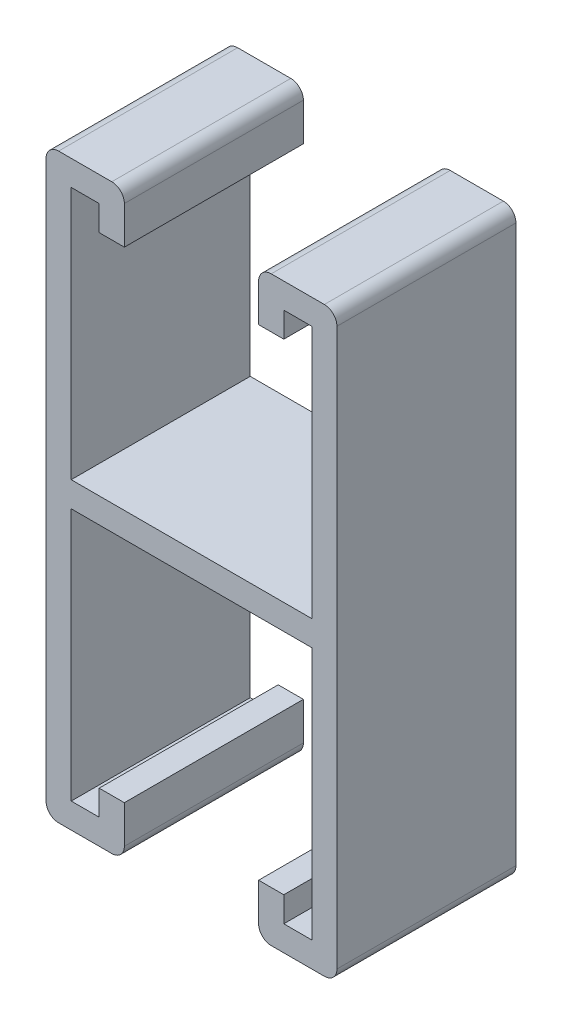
from build123d import *

# Parameters (mm, degrees)
BASE_EXTRUDE_DEPTH = 12.7


with BuildPart() as part:
    # Sketch1 → Base-Extrude (new, symmetric)
    with BuildSketch(Plane.XY):
        with BuildLine():
            Line((-11.3109375, 41.275), (-18.8515625, 41.275))
            ThreePointArc((-18.8515625, 41.275), (-20.114411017, 40.751911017), (-20.6375, 39.4890625))
            Line((-20.6375, 39.4890625), (-20.6375, -39.4890625))
            ThreePointArc((-20.6375, -39.4890625), (-20.114411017, -40.751911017), (-18.8515625, -41.275))
            Line((-18.8515625, -41.275), (-11.3109375, -41.275))
            ThreePointArc((-11.3109375, -41.275), (-10.048088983, -40.751911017), (-9.525, -39.4890625))
            Line((-9.525, -39.4890625), (-9.525, -34.13125))
            Line((-9.525, -34.13125), (-13.096875, -34.13125))
            Line((-13.096875, -34.13125), (-13.096875, -37.703125))
            Line((-13.096875, -37.703125), (-17.065625, -37.703125))
            Line((-17.065625, -37.703125), (-17.065625, -1.7859375))
            Line((-17.065625, -1.7859375), (17.065625, -1.7859375))
            Line((17.065625, -1.7859375), (17.065625, -37.703125))
            Line((17.065625, -37.703125), (13.096875, -37.703125))
            Line((13.096875, -37.703125), (13.096875, -34.13125))
            Line((13.096875, -34.13125), (9.525, -34.13125))
            Line((9.525, -34.13125), (9.525, -39.4890625))
            ThreePointArc((9.525, -39.4890625), (10.048088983, -40.751911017), (11.3109375, -41.275))
            Line((11.3109375, -41.275), (18.8515625, -41.275))
            ThreePointArc((18.8515625, -41.275), (20.114411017, -40.751911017), (20.6375, -39.4890625))
            Line((20.6375, -39.4890625), (20.6375, 39.4890625))
            ThreePointArc((20.6375, 39.4890625), (20.114411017, 40.751911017), (18.8515625, 41.275))
            Line((18.8515625, 41.275), (11.3109375, 41.275))
            ThreePointArc((11.3109375, 41.275), (10.048088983, 40.751911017), (9.525, 39.4890625))
            Line((9.525, 39.4890625), (9.525, 34.13125))
            Line((9.525, 34.13125), (13.096875, 34.13125))
            Line((13.096875, 34.13125), (13.096875, 37.703125))
            Line((13.096875, 37.703125), (17.065625, 37.703125))
            Line((17.065625, 37.703125), (17.065625, 1.7859375))
            Line((17.065625, 1.7859375), (-17.065625, 1.7859375))
            Line((-17.065625, 1.7859375), (-17.065625, 37.703125))
            Line((-17.065625, 37.703125), (-13.096875, 37.703125))
            Line((-13.096875, 37.703125), (-13.096875, 34.13125))
            Line((-13.096875, 34.13125), (-9.525, 34.13125))
            Line((-9.525, 34.13125), (-9.525, 39.4890625))
            ThreePointArc((-9.525, 39.4890625), (-10.048088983, 40.751911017), (-11.3109375, 41.275))
        make_face()
    extrude(amount=BASE_EXTRUDE_DEPTH, both=True)


solid = part.part
